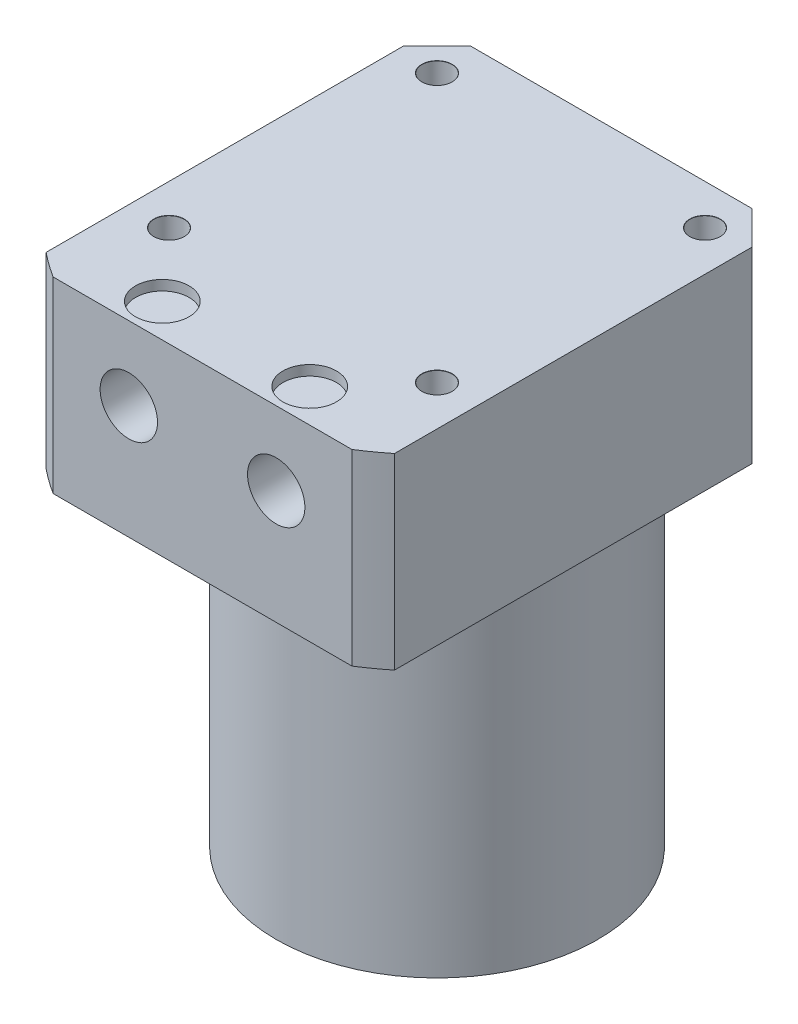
from build123d import *

# Parameters (mm, degrees)
SKETCH2_OUTSIDE_W                            = 113.41
SKETCH2_OUTSIDE_H                            = 113.41
SKETCH2_OUTSIDE_W_2                          = 52
SKETCH2_OUTSIDE_H_2                          = 61
CUT_EXTRUDE2_DEPTH                           = 100.219453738
CHAMFER1_SIZE                                = 5
F_8_0_8_DIAMETER_HOLE1_D                     = 8
F_8_0_8_DIAMETER_HOLE1_DEPTH                 = 1.5
G1_8_TAPPED_HOLE1_D                          = 8.566
G1_8_TAPPED_HOLE1_DEPTH                      = 22.18
CBORE_FOR_M4_HEX_SOCKET_HEAD_CAP_SCR_2_COUNT = 2
CBORE_FOR_M4_HEX_SOCKET_HEAD_CAP_SCR_2_PITCH = 40
CBORE_FOR_M4_HEX_SOCKET_HEAD_CAP_SCR_3_COUNT = 2
CBORE_FOR_M4_HEX_SOCKET_HEAD_CAP_SCR_3_PITCH = 56.568542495
CBORE_FOR_M4_HEX_SOCKET_HEAD_CAP_SCR_4_COUNT = 2
CBORE_FOR_M4_HEX_SOCKET_HEAD_CAP_SCR_4_PITCH = 40


with BuildPart() as part:
    # Sketch1 → Revolve1 (revolve)
    with BuildSketch(Plane.XY, mode=Mode.PRIVATE) as revolve1_sk:
        Polygon((0, 0), (-24, 0), (-24, 52), (-41.5, 52), (-41.5, 80), (0, 80), align=None)
    revolve(revolve1_sk.sketch.rotate(Axis((0, 87.050829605, 0), (0, -1, 0)), 270), axis=Axis((0, 87.050829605, 0), (0, -1, 0)))

    # Sketch2 outside → Cut-Extrude2 (cut, through all)
    with BuildSketch(Plane(origin=(0, 80, 0), x_dir=(1, 0, 0), z_dir=(0, 1, 0))):
        Rectangle(SKETCH2_OUTSIDE_W, SKETCH2_OUTSIDE_H)
        with Locations((0, -4.5)):
            Rectangle(SKETCH2_OUTSIDE_W_2, SKETCH2_OUTSIDE_H_2, mode=Mode.SUBTRACT)
    extrude(amount=-CUT_EXTRUDE2_DEPTH, mode=Mode.SUBTRACT)

    # Chamfer1
    chamfer1_edges = [part.edges().sort_by_distance(p)[0] for p in [
        (-26, 66, -26),
        (26, 66, -26),
    ]]
    chamfer(chamfer1_edges, length=CHAMFER1_SIZE)

    # 8.0 _8_ Diameter Hole1
    with Locations(Plane(origin=(-22.940510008, 80, 22.705104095), x_dir=(1, 0, 0), z_dir=(0, 1, 0))):
        with Locations((11.940510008, -7.294895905), (33.940510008, -7.294895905)):
            Hole(F_8_0_8_DIAMETER_HOLE1_D / 2, depth=F_8_0_8_DIAMETER_HOLE1_DEPTH)

    # G1_8 Tapped Hole1
    with Locations(Plane.XY.offset(35)):
        with Locations((-11, 69), (11, 69)):
            Hole(G1_8_TAPPED_HOLE1_D / 2, depth=G1_8_TAPPED_HOLE1_DEPTH)

    # Sketch7 → CBORE for M4 Hex Socket Head Cap Screw1 (revolve, cut)
    with BuildSketch(Plane(origin=(-20, 52, -20), x_dir=(0, 0, -1), z_dir=(1, 0, 0))):
        Polygon((0, 0), (0, 28), (2.275, 28), (2.25, 27.975), (2.25, 4), (4, 4), (4, 0), align=None)
    cbore_for_m4_hex_socket_head_cap_screw1 = revolve(axis=Axis((-20, 45.65, -20), (0, 1, 0)), mode=Mode.SUBTRACT)

    # CBORE for M4 Hex Socket Head Cap Scr 2: CBORE for M4 Hex Socket Head Cap Screw1 ×2
    with Locations(*[(i * CBORE_FOR_M4_HEX_SOCKET_HEAD_CAP_SCR_2_PITCH, 0, 0) for i in range(1, CBORE_FOR_M4_HEX_SOCKET_HEAD_CAP_SCR_2_COUNT)]):
        add(cbore_for_m4_hex_socket_head_cap_screw1, mode=Mode.SUBTRACT)

    # CBORE for M4 Hex Socket Head Cap Scr 3: CBORE for M4 Hex Socket Head Cap Screw1 ×2
    with Locations(*[Vector(0.7071067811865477, 0, 0.7071067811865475) * (i * CBORE_FOR_M4_HEX_SOCKET_HEAD_CAP_SCR_3_PITCH) for i in range(1, CBORE_FOR_M4_HEX_SOCKET_HEAD_CAP_SCR_3_COUNT)]):
        add(cbore_for_m4_hex_socket_head_cap_screw1, mode=Mode.SUBTRACT)

    # CBORE for M4 Hex Socket Head Cap Scr 4: CBORE for M4 Hex Socket Head Cap Screw1 ×2
    with Locations(*[(0, 0, i * CBORE_FOR_M4_HEX_SOCKET_HEAD_CAP_SCR_4_PITCH) for i in range(1, CBORE_FOR_M4_HEX_SOCKET_HEAD_CAP_SCR_4_COUNT)]):
        add(cbore_for_m4_hex_socket_head_cap_screw1, mode=Mode.SUBTRACT)


solid = part.part
